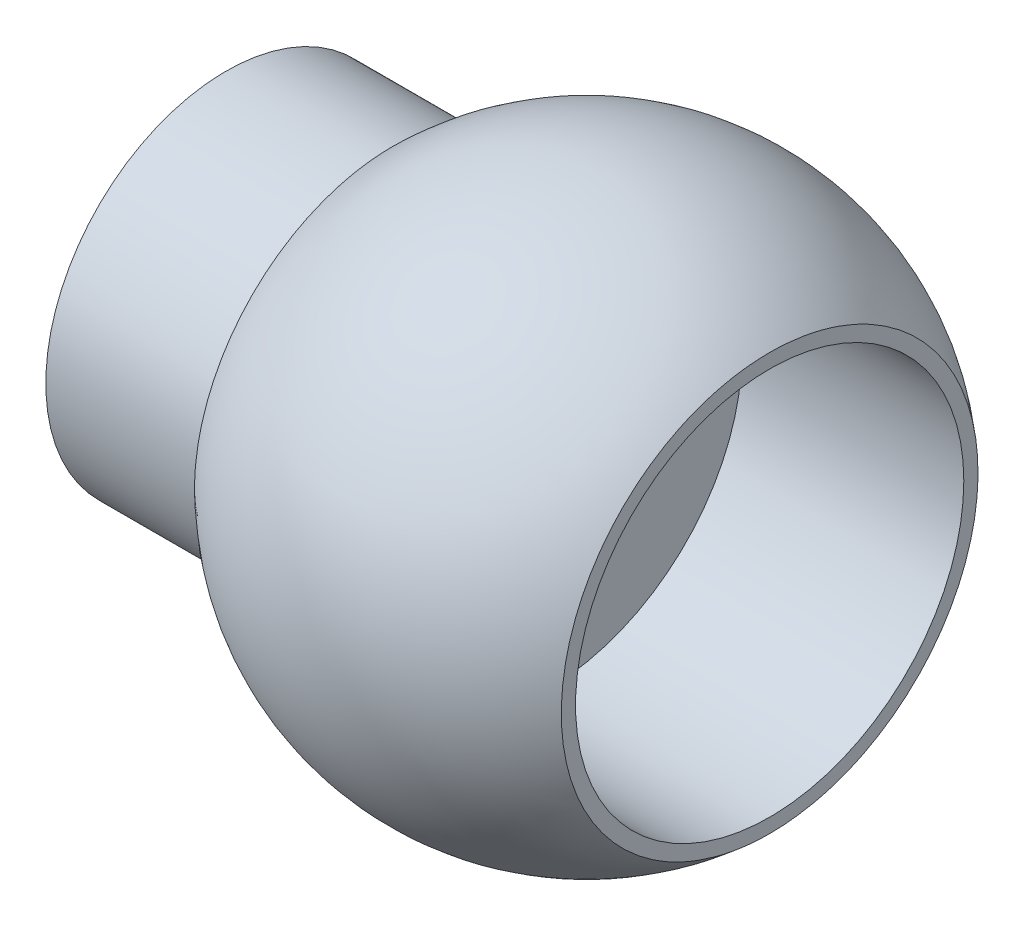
ISO-10303-21;
HEADER;
FILE_DESCRIPTION(('STEP AP214'),'2;1');
FILE_NAME('part.step','',(''),(''),'','','');
FILE_SCHEMA(('AUTOMOTIVE_DESIGN { 1 0 10303 214 1 1 1 1 }'));
ENDSEC;
DATA;
#1=APPLICATION_CONTEXT('core data for automotive mechanical design processes');
#2=APPLICATION_PROTOCOL_DEFINITION('international standard','automotive_design',2000,#1);
#3=PRODUCT_CONTEXT('',#1,'mechanical');
#4=PRODUCT('Part','Part','',(#3));
#5=PRODUCT_RELATED_PRODUCT_CATEGORY('part','',(#4));
#6=PRODUCT_DEFINITION_FORMATION('','',#4);
#7=PRODUCT_DEFINITION_CONTEXT('part definition',#1,'design');
#8=PRODUCT_DEFINITION('design','',#6,#7);
#9=PRODUCT_DEFINITION_SHAPE('','',#8);
#10=(LENGTH_UNIT() NAMED_UNIT(*) SI_UNIT(.MILLI.,.METRE.));
#11=(NAMED_UNIT(*) PLANE_ANGLE_UNIT() SI_UNIT($,.RADIAN.));
#12=(NAMED_UNIT(*) SI_UNIT($,.STERADIAN.) SOLID_ANGLE_UNIT());
#13=UNCERTAINTY_MEASURE_WITH_UNIT(LENGTH_MEASURE(1.E-05),#10,'distance_accuracy_value','');
#14=(GEOMETRIC_REPRESENTATION_CONTEXT(3) GLOBAL_UNCERTAINTY_ASSIGNED_CONTEXT((#13)) GLOBAL_UNIT_ASSIGNED_CONTEXT((#10,
#11,#12)) REPRESENTATION_CONTEXT('',''));
#15=CARTESIAN_POINT('',(0.,0.,0.));
#16=DIRECTION('',(0.,0.,1.));
#17=DIRECTION('',(1.,0.,0.));
#18=AXIS2_PLACEMENT_3D('',#15,#16,#17);
#19=CARTESIAN_POINT('',(-7.48,0.,0.));
#20=DIRECTION('',(1.,0.,0.));
#21=DIRECTION('',(0.,0.,-1.));
#22=AXIS2_PLACEMENT_3D('',#19,#20,#21);
#23=CYLINDRICAL_SURFACE('',#22,2.);
#24=CARTESIAN_POINT('',(-6.5,0.,0.));
#25=DIRECTION('',(1.,0.,0.));
#26=DIRECTION('',(0.,0.,-1.));
#27=AXIS2_PLACEMENT_3D('',#24,#25,#26);
#28=CIRCLE('',#27,2.);
#29=CARTESIAN_POINT('',(-6.5,0.,-2.));
#30=VERTEX_POINT('',#29);
#31=EDGE_CURVE('E22',#30,#30,#28,.F.);
#32=ORIENTED_EDGE('',*,*,#31,.T.);
#33=EDGE_LOOP('',(#32));
#34=FACE_BOUND('',#33,.T.);
#35=CARTESIAN_POINT('',(-0.7,0.,0.));
#36=DIRECTION('',(1.,0.,0.));
#37=DIRECTION('',(0.,0.,-1.));
#38=AXIS2_PLACEMENT_3D('',#35,#36,#37);
#39=CIRCLE('',#38,2.);
#40=CARTESIAN_POINT('',(-0.7,0.,-2.));
#41=VERTEX_POINT('',#40);
#42=EDGE_CURVE('E85',#41,#41,#39,.F.);
#43=ORIENTED_EDGE('',*,*,#42,.F.);
#44=EDGE_LOOP('',(#43));
#45=FACE_BOUND('',#44,.T.);
#46=ADVANCED_FACE('F16',(#34,#45),#23,.F.);
#47=CARTESIAN_POINT('',(-6.5,0.,0.));
#48=DIRECTION('',(1.,0.,0.));
#49=DIRECTION('',(0.,0.,-1.));
#50=AXIS2_PLACEMENT_3D('',#47,#48,#49);
#51=PLANE('',#50);
#52=ORIENTED_EDGE('',*,*,#31,.F.);
#53=EDGE_LOOP('',(#52));
#54=FACE_BOUND('',#53,.T.);
#55=CARTESIAN_POINT('',(-6.5,0.,0.));
#56=DIRECTION('',(1.,0.,0.));
#57=DIRECTION('',(0.,0.,-1.));
#58=AXIS2_PLACEMENT_3D('',#55,#56,#57);
#59=CIRCLE('',#58,3.25);
#60=CARTESIAN_POINT('',(-6.5,0.,-3.25));
#61=VERTEX_POINT('',#60);
#62=EDGE_CURVE('E81',#61,#61,#59,.T.);
#63=ORIENTED_EDGE('',*,*,#62,.F.);
#64=EDGE_LOOP('',(#63));
#65=FACE_BOUND('',#64,.T.);
#66=ADVANCED_FACE('F95',(#54,#65),#51,.F.);
#67=CARTESIAN_POINT('',(-0.7,0.,0.));
#68=DIRECTION('',(1.,0.,0.));
#69=DIRECTION('',(0.,0.,-1.));
#70=AXIS2_PLACEMENT_3D('',#67,#68,#69);
#71=PLANE('',#70);
#72=ORIENTED_EDGE('',*,*,#42,.T.);
#73=EDGE_LOOP('',(#72));
#74=FACE_BOUND('',#73,.T.);
#75=CARTESIAN_POINT('',(-0.7,0.,0.));
#76=DIRECTION('',(1.,0.,0.));
#77=DIRECTION('',(0.,0.,-1.));
#78=AXIS2_PLACEMENT_3D('',#75,#76,#77);
#79=CIRCLE('',#78,3.5);
#80=CARTESIAN_POINT('',(-0.7,0.,-3.5));
#81=VERTEX_POINT('',#80);
#82=EDGE_CURVE('E79',#81,#81,#79,.T.);
#83=ORIENTED_EDGE('',*,*,#82,.T.);
#84=EDGE_LOOP('',(#83));
#85=FACE_BOUND('',#84,.T.);
#86=ADVANCED_FACE('F75',(#74,#85),#71,.T.);
#87=CARTESIAN_POINT('',(-6.99,0.,0.));
#88=DIRECTION('',(1.,0.,0.));
#89=DIRECTION('',(0.,0.,-1.));
#90=AXIS2_PLACEMENT_3D('',#87,#88,#89);
#91=CYLINDRICAL_SURFACE('',#90,3.25);
#92=ORIENTED_EDGE('',*,*,#62,.T.);
#93=EDGE_LOOP('',(#92));
#94=FACE_BOUND('',#93,.T.);
#95=CARTESIAN_POINT('',(-3.5,0.,0.));
#96=DIRECTION('',(1.,0.,0.));
#97=DIRECTION('',(0.,0.,-1.));
#98=AXIS2_PLACEMENT_3D('',#95,#96,#97);
#99=CIRCLE('',#98,3.25);
#100=CARTESIAN_POINT('',(-3.5,0.,-3.25));
#101=VERTEX_POINT('',#100);
#102=EDGE_CURVE('E45',#101,#101,#99,.F.);
#103=ORIENTED_EDGE('',*,*,#102,.T.);
#104=EDGE_LOOP('',(#103));
#105=FACE_BOUND('',#104,.T.);
#106=ADVANCED_FACE('F70',(#94,#105),#91,.T.);
#107=CARTESIAN_POINT('',(3.3,0.,0.));
#108=DIRECTION('',(1.,0.,0.));
#109=DIRECTION('',(0.,0.,-1.));
#110=AXIS2_PLACEMENT_3D('',#107,#108,#109);
#111=CYLINDRICAL_SURFACE('',#110,3.5);
#112=ORIENTED_EDGE('',*,*,#82,.F.);
#113=EDGE_LOOP('',(#112));
#114=FACE_BOUND('',#113,.T.);
#115=CARTESIAN_POINT('',(3.3,0.,0.));
#116=DIRECTION('',(1.,0.,0.));
#117=DIRECTION('',(0.,0.,-1.));
#118=AXIS2_PLACEMENT_3D('',#115,#116,#117);
#119=CIRCLE('',#118,3.5);
#120=CARTESIAN_POINT('',(3.3,0.,-3.5));
#121=VERTEX_POINT('',#120);
#122=EDGE_CURVE('E42',#121,#121,#119,.F.);
#123=ORIENTED_EDGE('',*,*,#122,.F.);
#124=EDGE_LOOP('',(#123));
#125=FACE_BOUND('',#124,.T.);
#126=ADVANCED_FACE('F57',(#114,#125),#111,.F.);
#127=CARTESIAN_POINT('',(-3.5,0.,0.));
#128=DIRECTION('',(1.,0.,0.));
#129=DIRECTION('',(0.,0.,-1.));
#130=AXIS2_PLACEMENT_3D('',#127,#128,#129);
#131=PLANE('',#130);
#132=ORIENTED_EDGE('',*,*,#102,.F.);
#133=EDGE_LOOP('',(#132));
#134=FACE_BOUND('',#133,.T.);
#135=CARTESIAN_POINT('',(-3.5,3.57071421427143,0.));
#136=CARTESIAN_POINT('',(-3.5,3.57070609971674,0.200603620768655));
#137=CARTESIAN_POINT('',(-3.5,3.55375519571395,0.401327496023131));
#138=CARTESIAN_POINT('',(-3.5,3.48637881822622,0.797218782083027));
#139=CARTESIAN_POINT('',(-3.5,3.43591986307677,0.992380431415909));
#140=CARTESIAN_POINT('',(-3.5,3.30296408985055,1.37139686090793));
#141=CARTESIAN_POINT('',(-3.5,3.22048003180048,1.55525611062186));
#142=CARTESIAN_POINT('',(-3.5,3.02583243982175,1.9064747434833));
#143=CARTESIAN_POINT('',(-3.5,2.91367495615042,2.07383748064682));
#144=CARTESIAN_POINT('',(-3.5,2.66284573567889,2.387375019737));
#145=CARTESIAN_POINT('',(-3.5,2.5241717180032,2.53354799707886));
#146=CARTESIAN_POINT('',(-3.5,2.2242471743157,2.80054218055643));
#147=CARTESIAN_POINT('',(-3.49999999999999,2.06299593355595,2.92136258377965));
#148=CARTESIAN_POINT('',(-3.50000000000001,1.72250042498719,3.13421478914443));
#149=CARTESIAN_POINT('',(-3.50000000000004,1.54325642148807,3.22624701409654));
#150=CARTESIAN_POINT('',(-3.49999999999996,1.17186203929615,3.37891246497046));
#151=CARTESIAN_POINT('',(-3.49999999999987,0.979711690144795,3.43954576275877));
#152=CARTESIAN_POINT('',(-3.49999999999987,0.587958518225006,3.52769257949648));
#153=CARTESIAN_POINT('',(-3.49999999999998,0.388355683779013,3.55520604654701));
#154=CARTESIAN_POINT('',(-3.50000000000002,-0.012635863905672,3.5763319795));
#155=CARTESIAN_POINT('',(-3.49999999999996,-0.214024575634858,3.56994447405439));
#156=CARTESIAN_POINT('',(-3.49999999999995,-0.612870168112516,3.52344999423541));
#157=CARTESIAN_POINT('',(-3.5,-0.810327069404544,3.48334319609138));
#158=CARTESIAN_POINT('',(-3.5,-1.1957071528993,3.37054815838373));
#159=CARTESIAN_POINT('',(-3.49999999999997,-1.3836302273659,3.29785955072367));
#160=CARTESIAN_POINT('',(-3.49999999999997,-1.74461226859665,3.12196123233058));
#161=CARTESIAN_POINT('',(-3.5,-1.9176706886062,3.01875039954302));
#162=CARTESIAN_POINT('',(-3.5,-2.24398880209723,2.78474770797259));
#163=CARTESIAN_POINT('',(-3.49999999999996,-2.39725017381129,2.6539581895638));
#164=CARTESIAN_POINT('',(-3.49999999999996,-2.67961506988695,2.36853514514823));
#165=CARTESIAN_POINT('',(-3.49999999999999,-2.80872300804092,2.21390598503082));
#166=CARTESIAN_POINT('',(-3.50000000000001,-3.03920517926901,1.88508607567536));
#167=CARTESIAN_POINT('',(-3.5,-3.14056688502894,1.71088654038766));
#168=CARTESIAN_POINT('',(-3.5,-3.31266491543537,1.34783858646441));
#169=CARTESIAN_POINT('',(-3.5,-3.38337751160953,1.15897895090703));
#170=CARTESIAN_POINT('',(-3.5,-3.49195197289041,0.772301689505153));
#171=CARTESIAN_POINT('',(-3.5,-3.52987908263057,0.574502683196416));
#172=CARTESIAN_POINT('',(-3.5,-3.55753627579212,0.312866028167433));
#173=CARTESIAN_POINT('',(-3.5,-3.56247635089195,0.25038513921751));
#174=CARTESIAN_POINT('',(-3.5,-3.56906489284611,0.125273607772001));
#175=CARTESIAN_POINT('',(-3.5,-3.57071497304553,0.0626430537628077));
#176=CARTESIAN_POINT('',(-3.5,-3.57071269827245,-0.125158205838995));
#177=CARTESIAN_POINT('',(-3.5,-3.56412130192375,-0.250366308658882));
#178=CARTESIAN_POINT('',(-3.5,-3.5378372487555,-0.499423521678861));
#179=CARTESIAN_POINT('',(-3.5,-3.51813631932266,-0.623271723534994));
#180=CARTESIAN_POINT('',(-3.5,-3.45005034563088,-0.941970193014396));
#181=CARTESIAN_POINT('',(-3.5,-3.3915421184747,-1.13475821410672));
#182=CARTESIAN_POINT('',(-3.5,-3.24295799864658,-1.50785570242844));
#183=CARTESIAN_POINT('',(-3.5,-3.15285545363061,-1.6881544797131));
#184=CARTESIAN_POINT('',(-3.5,-2.94367767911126,-2.03102335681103));
#185=CARTESIAN_POINT('',(-3.50000000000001,-2.8246119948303,-2.19359927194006));
#186=CARTESIAN_POINT('',(-3.49999999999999,-2.5609002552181,-2.49641755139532));
#187=CARTESIAN_POINT('',(-3.49999999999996,-2.41625898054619,-2.63666408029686));
#188=CARTESIAN_POINT('',(-3.49999999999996,-2.10547344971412,-2.89089739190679));
#189=CARTESIAN_POINT('',(-3.49999999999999,-1.93932754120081,-3.00488215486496));
#190=CARTESIAN_POINT('',(-3.50000000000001,-1.59025207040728,-3.2033436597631));
#191=CARTESIAN_POINT('',(-3.5,-1.40732195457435,-3.28781942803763));
#192=CARTESIAN_POINT('',(-3.5,-1.02987863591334,-3.42485911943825));
#193=CARTESIAN_POINT('',(-3.5,-0.835365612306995,-3.47742353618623));
#194=CARTESIAN_POINT('',(-3.5,-0.440275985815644,-3.54915020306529));
#195=CARTESIAN_POINT('',(-3.5,-0.239699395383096,-3.56831252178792));
#196=CARTESIAN_POINT('',(-3.5,0.161824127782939,-3.57269129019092));
#197=CARTESIAN_POINT('',(-3.5,0.362771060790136,-3.55790771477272));
#198=CARTESIAN_POINT('',(-3.5,0.759330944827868,-3.49481424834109));
#199=CARTESIAN_POINT('',(-3.5,0.954943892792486,-3.44650433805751));
#200=CARTESIAN_POINT('',(-3.5,1.33528566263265,-3.31772869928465));
#201=CARTESIAN_POINT('',(-3.5,1.52001432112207,-3.2372624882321));
#202=CARTESIAN_POINT('',(-3.5,1.87333489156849,-3.04646101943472));
#203=CARTESIAN_POINT('',(-3.5,2.04192729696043,-2.93612667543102));
#204=CARTESIAN_POINT('',(-3.5,2.35818217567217,-2.68873213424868));
#205=CARTESIAN_POINT('',(-3.5,2.50584645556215,-2.55167424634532));
#206=CARTESIAN_POINT('',(-3.5,2.77609973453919,-2.25468034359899));
#207=CARTESIAN_POINT('',(-3.49999999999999,2.89868362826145,-2.0947396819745));
#208=CARTESIAN_POINT('',(-3.5,3.1152985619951,-1.75649625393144));
#209=CARTESIAN_POINT('',(-3.5,3.2093182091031,-1.57818619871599));
#210=CARTESIAN_POINT('',(-3.5,3.36599778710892,-1.20842817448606));
#211=CARTESIAN_POINT('',(-3.49999999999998,3.42868897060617,-1.01699351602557));
#212=CARTESIAN_POINT('',(-3.49999999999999,3.50668476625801,-0.687249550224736));
#213=CARTESIAN_POINT('',(-3.5,3.53066207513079,-0.550926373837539));
#214=CARTESIAN_POINT('',(-3.5,3.56267959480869,-0.276421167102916));
#215=CARTESIAN_POINT('',(-3.5,3.57071980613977,-0.138239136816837));
#216=CARTESIAN_POINT('',(-3.5,3.57071421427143,0.));
#217=B_SPLINE_CURVE_WITH_KNOTS('',3,(#135,#136,#137,#138,#139,#140,#141,#142,#143,#144,#145,
#146,#147,#148,#149,#150,#151,#152,#153,#154,#155,#156,#157,#158,#159,#160,#161,#162,#163,#164,
#165,#166,#167,#168,#169,#170,#171,#172,#173,#174,#175,#176,#177,#178,#179,#180,#181,#182,#183,
#184,#185,#186,#187,#188,#189,#190,#191,#192,#193,#194,#195,#196,#197,#198,#199,#200,#201,#202,
#203,#204,#205,#206,#207,#208,#209,#210,#211,#212,#213,#214,#215,#216),.UNSPECIFIED.,.T.,.F.,(4,
2,2,2,2,2,2,2,2,2,2,2,2,2,2,2,2,2,2,2,2,2,2,2,2,2,2,2,2,2,2,2,2,2,2,2,2,2,2,2,4),(0.,
0.601309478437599,1.20322069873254,1.80489234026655,2.40644139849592,3.00804222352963,
3.60966209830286,4.2112731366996,4.81288279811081,5.41449340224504,6.01610349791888,
6.61771044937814,7.21932419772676,7.82096006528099,8.42254489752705,9.02401968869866,
9.62576559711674,10.2279765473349,10.8289862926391,11.0169575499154,11.2048366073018,
11.5802111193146,11.9558227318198,12.5571788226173,13.1590434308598,13.7607099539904,
14.3622641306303,14.9638645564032,15.5654848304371,16.1670957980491,16.7687055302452,
17.3703157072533,17.9719262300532,18.5735457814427,19.1751469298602,19.7766961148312,
20.3783676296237,20.9802788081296,21.5815883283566,21.9959602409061,22.4103321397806),.UNSPECIFIED.);
#218=CARTESIAN_POINT('',(-3.5,3.57071421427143,0.));
#219=VERTEX_POINT('',#218);
#220=EDGE_CURVE('E28',#219,#219,#217,.T.);
#221=ORIENTED_EDGE('',*,*,#220,.F.);
#222=EDGE_LOOP('',(#221));
#223=FACE_BOUND('',#222,.T.);
#224=ADVANCED_FACE('F53',(#134,#223),#131,.F.);
#225=CARTESIAN_POINT('',(3.3,0.,0.));
#226=DIRECTION('',(1.,0.,0.));
#227=DIRECTION('',(0.,0.,-1.));
#228=AXIS2_PLACEMENT_3D('',#225,#226,#227);
#229=PLANE('',#228);
#230=ORIENTED_EDGE('',*,*,#122,.T.);
#231=EDGE_LOOP('',(#230));
#232=FACE_BOUND('',#231,.T.);
#233=CARTESIAN_POINT('',(3.3,-3.75632799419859,0.));
#234=CARTESIAN_POINT('',(3.3,-3.75631798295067,0.210931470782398));
#235=CARTESIAN_POINT('',(3.3,-3.73849688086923,0.422062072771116));
#236=CARTESIAN_POINT('',(3.3,-3.66763814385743,0.838558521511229));
#237=CARTESIAN_POINT('',(3.3,-3.61454600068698,1.04391493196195));
#238=CARTESIAN_POINT('',(3.3,-3.47465515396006,1.44269461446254));
#239=CARTESIAN_POINT('',(3.3,-3.38787701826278,1.63612508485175));
#240=CARTESIAN_POINT('',(3.3,-3.18310741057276,2.00560028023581));
#241=CARTESIAN_POINT('',(3.3,-3.06512617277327,2.18165067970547));
#242=CARTESIAN_POINT('',(3.3,-2.80126801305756,2.51147399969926));
#243=CARTESIAN_POINT('',(3.3,-2.65538729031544,2.66524387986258));
#244=CARTESIAN_POINT('',(3.3,-2.33987252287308,2.94611775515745));
#245=CARTESIAN_POINT('',(3.3,-2.17023717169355,3.07322028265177));
#246=CARTESIAN_POINT('',(3.3,-1.8120396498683,3.29713852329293));
#247=CARTESIAN_POINT('',(3.30000000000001,-1.62347794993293,3.39395498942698));
#248=CARTESIAN_POINT('',(3.29999999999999,-1.23277731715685,3.55455606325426));
#249=CARTESIAN_POINT('',(3.29999999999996,-1.03063845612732,3.61834084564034));
#250=CARTESIAN_POINT('',(3.29999999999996,-0.618522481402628,3.71107033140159));
#251=CARTESIAN_POINT('',(3.29999999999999,-0.408545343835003,3.74001492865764));
#252=CARTESIAN_POINT('',(3.30000000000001,0.013294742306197,3.76223653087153));
#253=CARTESIAN_POINT('',(3.29999999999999,0.225157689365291,3.75551356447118));
#254=CARTESIAN_POINT('',(3.29999999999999,0.64472091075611,3.70661154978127));
#255=CARTESIAN_POINT('',(3.3,0.852421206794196,3.66443268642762));
#256=CARTESIAN_POINT('',(3.3,1.25789122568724,3.54573939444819));
#257=CARTESIAN_POINT('',(3.29999999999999,1.45566083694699,3.46922458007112));
#258=CARTESIAN_POINT('',(3.29999999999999,1.74040502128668,3.33049520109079));
#259=CARTESIAN_POINT('',(3.3,1.83338002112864,3.28022678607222));
#260=CARTESIAN_POINT('',(3.3,2.01476988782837,3.17203965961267));
#261=CARTESIAN_POINT('',(3.3,2.10318580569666,3.11412272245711));
#262=CARTESIAN_POINT('',(3.3,2.27478236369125,2.99107135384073));
#263=CARTESIAN_POINT('',(3.3,2.35796535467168,2.92594020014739));
#264=CARTESIAN_POINT('',(3.3,2.51861653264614,2.78886068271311));
#265=CARTESIAN_POINT('',(3.29999999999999,2.59607912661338,2.71690580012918));
#266=CARTESIAN_POINT('',(3.29999999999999,2.81884621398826,2.49170464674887));
#267=CARTESIAN_POINT('',(3.3,2.9547574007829,2.32895847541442));
#268=CARTESIAN_POINT('',(3.3,3.19727829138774,1.98293865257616));
#269=CARTESIAN_POINT('',(3.3,3.30388912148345,1.79966579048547));
#270=CARTESIAN_POINT('',(3.3,3.43962323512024,1.51334707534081));
#271=CARTESIAN_POINT('',(3.3,3.48087165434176,1.41588511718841));
#272=CARTESIAN_POINT('',(3.3,3.55498313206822,1.21788546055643));
#273=CARTESIAN_POINT('',(3.3,3.58785296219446,1.1173503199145));
#274=CARTESIAN_POINT('',(3.3,3.64495399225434,0.914029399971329));
#275=CARTESIAN_POINT('',(3.3,3.66919815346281,0.811247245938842));
#276=CARTESIAN_POINT('',(3.3,3.70894507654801,0.604027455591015));
#277=CARTESIAN_POINT('',(3.3,3.72445047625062,0.499590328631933));
#278=CARTESIAN_POINT('',(3.3,3.7424601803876,0.329148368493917));
#279=CARTESIAN_POINT('',(3.3,3.74765943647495,0.263417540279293));
#280=CARTESIAN_POINT('',(3.3,3.75459386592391,0.131798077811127));
#281=CARTESIAN_POINT('',(3.3,3.75632996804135,0.0659094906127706));
#282=CARTESIAN_POINT('',(3.3,3.75632294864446,-0.168478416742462));
#283=CARTESIAN_POINT('',(3.3,3.74496096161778,-0.337093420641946));
#284=CARTESIAN_POINT('',(3.3,3.69968838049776,-0.67146814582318));
#285=CARTESIAN_POINT('',(3.3,3.66573847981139,-0.837222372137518));
#286=CARTESIAN_POINT('',(3.3,3.56455738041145,-1.20350702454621));
#287=CARTESIAN_POINT('',(3.3,3.49112422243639,-1.40236151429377));
#288=CARTESIAN_POINT('',(3.3,3.31190996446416,-1.78491410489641));
#289=CARTESIAN_POINT('',(3.29999999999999,3.20612133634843,-1.96860866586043));
#290=CARTESIAN_POINT('',(3.30000000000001,2.96521024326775,-2.31562598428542));
#291=CARTESIAN_POINT('',(3.30000000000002,2.83009038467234,-2.47895054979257));
#292=CARTESIAN_POINT('',(3.29999999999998,2.53435703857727,-2.78058401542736));
#293=CARTESIAN_POINT('',(3.29999999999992,2.37374495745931,-2.91889429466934));
#294=CARTESIAN_POINT('',(3.29999999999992,2.03157654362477,-3.16659192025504));
#295=CARTESIAN_POINT('',(3.29999999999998,1.85001973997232,-3.27597861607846));
#296=CARTESIAN_POINT('',(3.30000000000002,1.47111680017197,-3.46271948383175));
#297=CARTESIAN_POINT('',(3.30000000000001,1.27377050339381,-3.54007332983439));
#298=CARTESIAN_POINT('',(3.29999999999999,0.868893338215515,-3.66055106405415));
#299=CARTESIAN_POINT('',(3.3,0.661362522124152,-3.70367512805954));
#300=CARTESIAN_POINT('',(3.3,0.242006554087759,-3.75446970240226));
#301=CARTESIAN_POINT('',(3.3,0.0301814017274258,-3.7621402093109));
#302=CARTESIAN_POINT('',(3.3,-0.391749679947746,-3.74180997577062));
#303=CARTESIAN_POINT('',(3.3,-0.601855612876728,-3.71380931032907));
#304=CARTESIAN_POINT('',(3.3,-1.01438529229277,-3.62293147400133));
#305=CARTESIAN_POINT('',(3.3,-1.21680900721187,-3.56005415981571));
#306=CARTESIAN_POINT('',(3.3,-1.60823202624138,-3.40120601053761));
#307=CARTESIAN_POINT('',(3.3,-1.79723099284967,-3.30523434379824));
#308=CARTESIAN_POINT('',(3.3,-2.15642376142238,-3.08292768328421));
#309=CARTESIAN_POINT('',(3.3,-2.32661858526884,-2.95659434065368));
#310=CARTESIAN_POINT('',(3.3,-2.6433619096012,-2.67716939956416));
#311=CARTESIAN_POINT('',(3.3,-2.78991363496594,-2.52408145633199));
#312=CARTESIAN_POINT('',(3.3,-3.05528450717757,-2.1954162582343));
#313=CARTESIAN_POINT('',(3.3,-3.17409455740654,-2.01983165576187));
#314=CARTESIAN_POINT('',(3.3,-3.380606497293,-1.65112109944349));
#315=CARTESIAN_POINT('',(3.3,-3.46828936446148,-1.45798450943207));
#316=CARTESIAN_POINT('',(3.3,-3.60985449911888,-1.05992727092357));
#317=CARTESIAN_POINT('',(3.29999999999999,-3.66378883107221,-0.855025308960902));
#318=CARTESIAN_POINT('',(3.3,-3.71883635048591,-0.540422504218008));
#319=CARTESIAN_POINT('',(3.3,-3.73288147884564,-0.432835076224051));
#320=CARTESIAN_POINT('',(3.3,-3.75162987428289,-0.216849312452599));
#321=CARTESIAN_POINT('',(3.3,-3.75633314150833,-0.108450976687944));
#322=CARTESIAN_POINT('',(3.3,-3.75632799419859,0.));
#323=B_SPLINE_CURVE_WITH_KNOTS('',3,(#233,#234,#235,#236,#237,#238,#239,#240,#241,#242,#243,
#244,#245,#246,#247,#248,#249,#250,#251,#252,#253,#254,#255,#256,#257,#258,#259,#260,#261,#262,
#263,#264,#265,#266,#267,#268,#269,#270,#271,#272,#273,#274,#275,#276,#277,#278,#279,#280,#281,
#282,#283,#284,#285,#286,#287,#288,#289,#290,#291,#292,#293,#294,#295,#296,#297,#298,#299,#300,
#301,#302,#303,#304,#305,#306,#307,#308,#309,#310,#311,#312,#313,#314,#315,#316,#317,#318,#319,
#320,#321,#322),.UNSPECIFIED.,.T.,.F.,(4,2,2,2,2,2,2,2,2,2,2,2,2,2,2,2,2,2,2,2,2,2,2,2,2,2,2,2,
2,2,2,2,2,2,2,2,2,2,2,2,2,2,2,2,4),(0.,0.632393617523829,1.26576682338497,1.89875391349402,
2.53153364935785,3.1643996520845,3.79730047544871,4.43018556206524,5.06306730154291,
5.69595096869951,6.32883412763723,6.96171398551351,7.59460095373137,7.91137453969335,
8.22807476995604,8.54463169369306,8.86149413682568,9.49438971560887,10.1272609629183,
10.4444401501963,10.7613621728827,11.0778059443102,11.394154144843,11.5918745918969,
11.7895420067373,12.2948211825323,12.8009819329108,13.4337916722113,14.0667487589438,
14.6996496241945,15.3325155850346,15.9653957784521,16.5982824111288,17.2311657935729,
17.8640492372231,18.4969313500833,19.1298160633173,19.7627166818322,20.3955828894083,
21.0283627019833,21.6613497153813,22.2947228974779,22.9271165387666,23.2522634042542,
23.5774102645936),.UNSPECIFIED.);
#324=CARTESIAN_POINT('',(3.3,-3.75632799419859,0.));
#325=VERTEX_POINT('',#324);
#326=EDGE_CURVE('E11',#325,#325,#323,.T.);
#327=ORIENTED_EDGE('',*,*,#326,.F.);
#328=EDGE_LOOP('',(#327));
#329=FACE_BOUND('',#328,.T.);
#330=ADVANCED_FACE('F36',(#232,#329),#229,.T.);
#331=CARTESIAN_POINT('',(0.,0.,0.));
#332=DIRECTION('',(0.,-1.,0.));
#333=DIRECTION('',(0.,0.,-1.));
#334=AXIS2_PLACEMENT_3D('',#331,#332,#333);
#335=SPHERICAL_SURFACE('',#334,5.);
#336=CARTESIAN_POINT('',(0.,-5.,0.));
#337=VERTEX_POINT('',#336);
#338=VERTEX_LOOP('',#337);
#339=FACE_BOUND('',#338,.T.);
#340=ORIENTED_EDGE('',*,*,#326,.T.);
#341=EDGE_LOOP('',(#340));
#342=FACE_BOUND('',#341,.T.);
#343=CARTESIAN_POINT('',(0.,5.,0.));
#344=VERTEX_POINT('',#343);
#345=VERTEX_LOOP('',#344);
#346=FACE_BOUND('',#345,.T.);
#347=ORIENTED_EDGE('',*,*,#220,.T.);
#348=EDGE_LOOP('',(#347));
#349=FACE_BOUND('',#348,.T.);
#350=ADVANCED_FACE('F18',(#339,#342,#346,#349),#335,.T.);
#351=CLOSED_SHELL('',(#46,#66,#86,#106,#126,#224,#330,#350));
#352=MANIFOLD_SOLID_BREP('B1',#351);
#353=ADVANCED_BREP_SHAPE_REPRESENTATION('',(#18,#352),#14);
#354=SHAPE_DEFINITION_REPRESENTATION(#9,#353);
ENDSEC;
END-ISO-10303-21;
